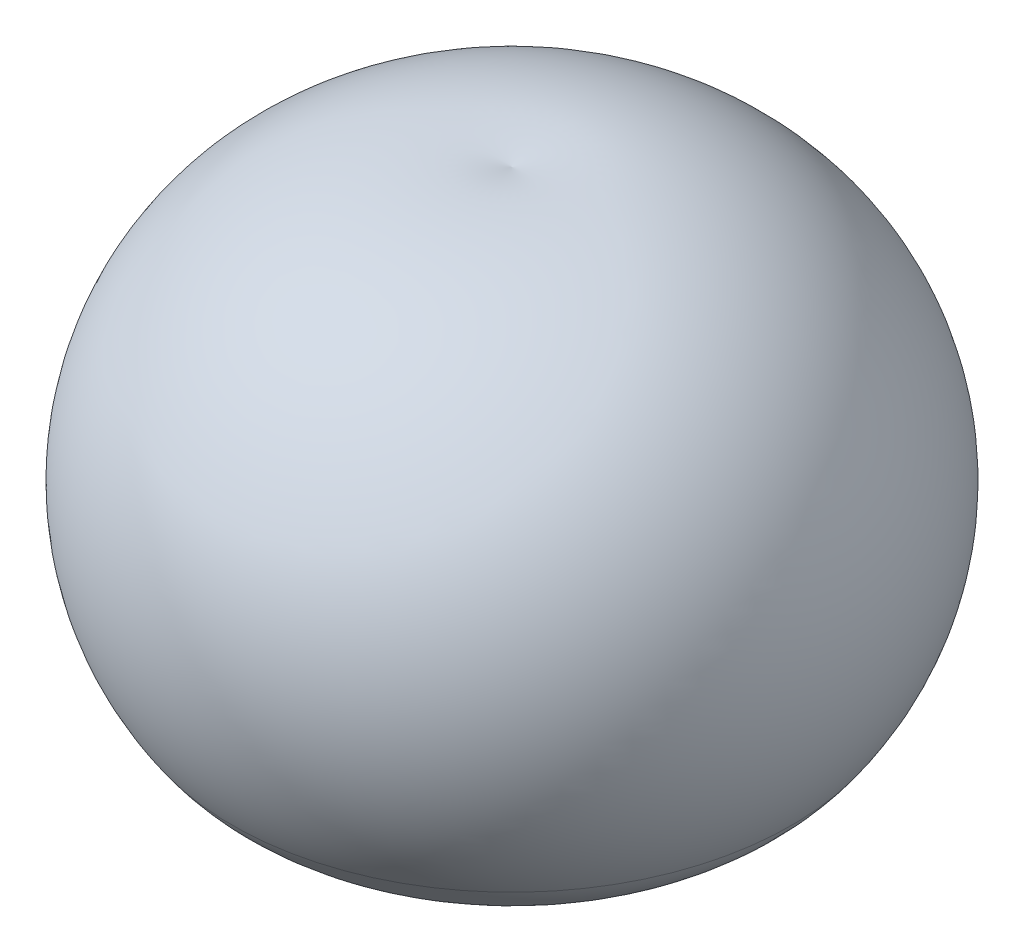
ISO-10303-21;
HEADER;
FILE_DESCRIPTION(('STEP AP214'),'2;1');
FILE_NAME('part.step','',(''),(''),'','','');
FILE_SCHEMA(('AUTOMOTIVE_DESIGN { 1 0 10303 214 1 1 1 1 }'));
ENDSEC;
DATA;
#1=APPLICATION_CONTEXT('core data for automotive mechanical design processes');
#2=APPLICATION_PROTOCOL_DEFINITION('international standard','automotive_design',2000,#1);
#3=PRODUCT_CONTEXT('',#1,'mechanical');
#4=PRODUCT('Part','Part','',(#3));
#5=PRODUCT_RELATED_PRODUCT_CATEGORY('part','',(#4));
#6=PRODUCT_DEFINITION_FORMATION('','',#4);
#7=PRODUCT_DEFINITION_CONTEXT('part definition',#1,'design');
#8=PRODUCT_DEFINITION('design','',#6,#7);
#9=PRODUCT_DEFINITION_SHAPE('','',#8);
#10=(LENGTH_UNIT() NAMED_UNIT(*) SI_UNIT(.MILLI.,.METRE.));
#11=(NAMED_UNIT(*) PLANE_ANGLE_UNIT() SI_UNIT($,.RADIAN.));
#12=(NAMED_UNIT(*) SI_UNIT($,.STERADIAN.) SOLID_ANGLE_UNIT());
#13=UNCERTAINTY_MEASURE_WITH_UNIT(LENGTH_MEASURE(1.E-05),#10,'distance_accuracy_value','');
#14=(GEOMETRIC_REPRESENTATION_CONTEXT(3) GLOBAL_UNCERTAINTY_ASSIGNED_CONTEXT((#13)) GLOBAL_UNIT_ASSIGNED_CONTEXT((#10,
#11,#12)) REPRESENTATION_CONTEXT('',''));
#15=CARTESIAN_POINT('',(0.,0.,0.));
#16=DIRECTION('',(0.,0.,1.));
#17=DIRECTION('',(1.,0.,0.));
#18=AXIS2_PLACEMENT_3D('',#15,#16,#17);
#19=CARTESIAN_POINT('',(0.,550.,-400.));
#20=DIRECTION('',(-1.,0.,0.));
#21=DIRECTION('',(0.,0.,-1.));
#22=AXIS2_PLACEMENT_3D('',#19,#20,#21);
#23=CIRCLE('',#22,2103.36247731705);
#24=TRIMMED_CURVE('',#23,(PARAMETER_VALUE(-1.76213335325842)),
(PARAMETER_VALUE(1.76213335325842)),.T.,.PARAMETER.);
#25=CARTESIAN_POINT('',(0.,550.,0.));
#26=DIRECTION('',(0.,-1.,0.));
#27=AXIS1_PLACEMENT('',#25,#26);
#28=SURFACE_OF_REVOLUTION('',#24,#27);
#29=CARTESIAN_POINT('',(0.,-656.43915409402,0.));
#30=DIRECTION('',(0.,-1.,0.));
#31=DIRECTION('',(0.,0.,-1.));
#32=AXIS2_PLACEMENT_3D('',#29,#30,#31);
#33=CIRCLE('',#32,2122.97367317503);
#34=CARTESIAN_POINT('',(0.,-656.43915409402,-2122.97367317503));
#35=VERTEX_POINT('',#34);
#36=EDGE_CURVE('E26',#35,#35,#33,.T.);
#37=ORIENTED_EDGE('',*,*,#36,.F.);
#38=EDGE_LOOP('',(#37));
#39=FACE_BOUND('',#38,.T.);
#40=CARTESIAN_POINT('',(1.66533453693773E-13,2614.97789600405,0.));
#41=VERTEX_POINT('',#40);
#42=VERTEX_LOOP('',#41);
#43=FACE_BOUND('',#42,.T.);
#44=ADVANCED_FACE('F17',(#39,#43),#28,.T.);
#45=CARTESIAN_POINT('',(0.,56.7242647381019,-1104.47075808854));
#46=DIRECTION('',(-1.,0.,0.));
#47=DIRECTION('',(0.,0.,-1.));
#48=AXIS2_PLACEMENT_3D('',#45,#46,#47);
#49=CIRCLE('',#48,1243.36247731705);
#50=TRIMMED_CURVE('',#49,(PARAMETER_VALUE(-2.66441232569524)),
(PARAMETER_VALUE(2.66441232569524)),.T.,.PARAMETER.);
#51=CARTESIAN_POINT('',(0.,56.7242647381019,0.));
#52=DIRECTION('',(0.,-1.,0.));
#53=AXIS1_PLACEMENT('',#51,#52);
#54=SURFACE_OF_REVOLUTION('',#50,#53);
#55=CARTESIAN_POINT('',(0.,-514.322663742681,0.));
#56=VERTEX_POINT('',#55);
#57=VERTEX_LOOP('',#56);
#58=FACE_BOUND('',#57,.T.);
#59=ORIENTED_EDGE('',*,*,#36,.T.);
#60=EDGE_LOOP('',(#59));
#61=FACE_BOUND('',#60,.T.);
#62=ADVANCED_FACE('F56',(#58,#61),#54,.T.);
#63=CLOSED_SHELL('',(#44,#62));
#64=CARTESIAN_POINT('',(0.,550.,0.));
#65=DIRECTION('',(0.,-1.,0.));
#66=DIRECTION('',(0.,0.,-1.));
#67=AXIS2_PLACEMENT_3D('',#64,#65,#66);
#68=DEGENERATE_TOROIDAL_SURFACE('',#67,400.,585.661401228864,.T.);
#69=CARTESIAN_POINT('',(0.,865.661683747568,0.));
#70=DIRECTION('',(0.,-1.,0.));
#71=DIRECTION('',(0.,0.,-1.));
#72=AXIS2_PLACEMENT_3D('',#69,#70,#71);
#73=CIRCLE('',#72,893.312252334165);
#74=CARTESIAN_POINT('',(0.,865.661683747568,-893.312252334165));
#75=VERTEX_POINT('',#74);
#76=EDGE_CURVE('E11',#75,#75,#73,.T.);
#77=ORIENTED_EDGE('',*,*,#76,.F.);
#78=EDGE_LOOP('',(#77));
#79=FACE_BOUND('',#78,.T.);
#80=CARTESIAN_POINT('',(0.,-35.1538436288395,0.));
#81=DIRECTION('',(0.,-1.,0.));
#82=DIRECTION('',(0.,0.,-1.));
#83=AXIS2_PLACEMENT_3D('',#80,#81,#82);
#84=CIRCLE('',#83,375.622629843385);
#85=CARTESIAN_POINT('',(0.,-35.1538436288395,-375.622629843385));
#86=VERTEX_POINT('',#85);
#87=EDGE_CURVE('E50',#86,#86,#84,.T.);
#88=ORIENTED_EDGE('',*,*,#87,.T.);
#89=EDGE_LOOP('',(#88));
#90=FACE_BOUND('',#89,.T.);
#91=ADVANCED_FACE('F19',(#79,#90),#68,.F.);
#92=CARTESIAN_POINT('',(0.,980.,344.781847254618));
#93=DIRECTION('',(-1.,0.,0.));
#94=DIRECTION('',(0.,0.,-1.));
#95=AXIS2_PLACEMENT_3D('',#92,#93,#94);
#96=CIRCLE('',#95,1243.36247731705);
#97=TRIMMED_CURVE('',#96,(PARAMETER_VALUE(-1.28981571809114)),
(PARAMETER_VALUE(1.28981571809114)),.T.,.PARAMETER.);
#98=CARTESIAN_POINT('',(0.,980.,0.));
#99=DIRECTION('',(0.,-1.,0.));
#100=AXIS1_PLACEMENT('',#98,#99);
#101=SURFACE_OF_REVOLUTION('',#97,#100);
#102=CARTESIAN_POINT('',(0.,2174.60274895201,0.));
#103=VERTEX_POINT('',#102);
#104=VERTEX_LOOP('',#103);
#105=FACE_BOUND('',#104,.T.);
#106=ORIENTED_EDGE('',*,*,#76,.T.);
#107=EDGE_LOOP('',(#106));
#108=FACE_BOUND('',#107,.T.);
#109=ADVANCED_FACE('F39',(#105,#108),#101,.F.);
#110=CARTESIAN_POINT('',(0.,287.669308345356,66.9951773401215));
#111=DIRECTION('',(-1.,0.,0.));
#112=DIRECTION('',(0.,0.,-1.));
#113=AXIS2_PLACEMENT_3D('',#110,#111,#112);
#114=CIRCLE('',#113,547.836938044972);
#115=TRIMMED_CURVE('',#114,(PARAMETER_VALUE(-1.4481990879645)),
(PARAMETER_VALUE(1.4481990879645)),.T.,.PARAMETER.);
#116=CARTESIAN_POINT('',(0.,287.669308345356,0.));
#117=DIRECTION('',(0.,-1.,0.));
#118=AXIS1_PLACEMENT('',#116,#117);
#119=SURFACE_OF_REVOLUTION('',#115,#118);
#120=ORIENTED_EDGE('',*,*,#87,.F.);
#121=EDGE_LOOP('',(#120));
#122=FACE_BOUND('',#121,.T.);
#123=CARTESIAN_POINT('',(0.,-256.055766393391,0.));
#124=VERTEX_POINT('',#123);
#125=VERTEX_LOOP('',#124);
#126=FACE_BOUND('',#125,.T.);
#127=ADVANCED_FACE('F42',(#122,#126),#119,.F.);
#128=CLOSED_SHELL('',(#91,#109,#127));
#129=ORIENTED_CLOSED_SHELL('',*,#128,.T.);
#130=BREP_WITH_VOIDS('B1',#63,(#129));
#131=ADVANCED_BREP_SHAPE_REPRESENTATION('',(#18,#130),#14);
#132=SHAPE_DEFINITION_REPRESENTATION(#9,#131);
ENDSEC;
END-ISO-10303-21;
